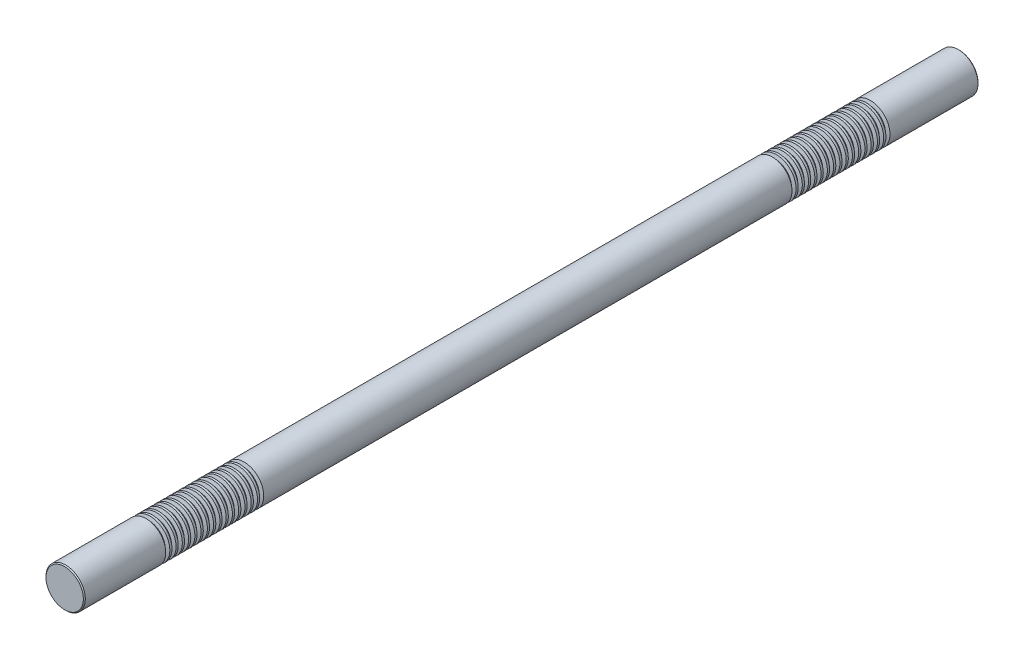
from build123d import *

# Parameters (mm, degrees)
SKETCH1_R           = 22
BOSS_EXTRUDE1_DEPTH = 500
CHAMFER1_SIZE       = 1.1
LPATTERN1_COUNT     = 16
LPATTERN1_PITCH     = 7
LPATTERN2_COUNT     = 2
LPATTERN2_PITCH     = 700


with BuildPart() as part:
    # Sketch1 → Boss-Extrude1 (new, symmetric)
    with BuildSketch(Plane.XY):
        Circle(SKETCH1_R)
    extrude(amount=BOSS_EXTRUDE1_DEPTH, both=True)

    # Chamfer1
    chamfer1_edges = [part.edges().sort_by_distance(p)[0] for p in [
        (-22, 0, -500),
        (-22, 0, 500),
    ]]
    chamfer(chamfer1_edges, length=CHAMFER1_SIZE)

    # Sketch2 → Cut-Revolve1 (revolve, cut)
    with BuildSketch(Plane(origin=(0, 0, 0), x_dir=(0, 0, -1), z_dir=(1, 0, 0)), mode=Mode.PRIVATE) as cut_revolve1_sk:
        Polygon((400.535898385, 22), (395.964101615, 22), (397.035898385, 18), (399.464101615, 18), align=None)
    cut_revolve1 = revolve(cut_revolve1_sk.sketch.rotate(Axis((0, 0, 500), (0, 0, -1)), 90), axis=Axis((0, 0, 500), (0, 0, -1)), mode=Mode.SUBTRACT)

    # LPattern1: Cut-Revolve1 ×16
    with Locations(*[(0, 0, i * LPATTERN1_PITCH) for i in range(1, LPATTERN1_COUNT)]):
        add(cut_revolve1, mode=Mode.SUBTRACT)

    # LPattern2: Cut-Revolve1 ×2
    with Locations(*[(0, 0, i * LPATTERN2_PITCH) for i in range(1, LPATTERN2_COUNT)]):
        add(cut_revolve1, mode=Mode.SUBTRACT)

    # LPattern2 copy 1 sketch → LPattern2 copy 1 (revolve, cut)
    with BuildSketch(Plane(origin=(0, 0, 707), x_dir=(0, 0, -1), z_dir=(1, 0, 0))):
        Polygon((400.535898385, 22), (395.964101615, 22), (397.035898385, 18), (399.464101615, 18), align=None)
    revolve(axis=Axis((0, 0, 1207), (0, 0, -1)), mode=Mode.SUBTRACT)

    # LPattern2 copy 2 sketch → LPattern2 copy 2 (revolve, cut)
    with BuildSketch(Plane(origin=(0, 0, 714), x_dir=(0, 0, -1), z_dir=(1, 0, 0))):
        Polygon((400.535898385, 22), (395.964101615, 22), (397.035898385, 18), (399.464101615, 18), align=None)
    revolve(axis=Axis((0, 0, 1214), (0, 0, -1)), mode=Mode.SUBTRACT)

    # LPattern2 copy 3 sketch → LPattern2 copy 3 (revolve, cut)
    with BuildSketch(Plane(origin=(0, 0, 721), x_dir=(0, 0, -1), z_dir=(1, 0, 0))):
        Polygon((400.535898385, 22), (395.964101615, 22), (397.035898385, 18), (399.464101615, 18), align=None)
    revolve(axis=Axis((0, 0, 1221), (0, 0, -1)), mode=Mode.SUBTRACT)

    # LPattern2 copy 4 sketch → LPattern2 copy 4 (revolve, cut)
    with BuildSketch(Plane(origin=(0, 0, 728), x_dir=(0, 0, -1), z_dir=(1, 0, 0))):
        Polygon((400.535898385, 22), (395.964101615, 22), (397.035898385, 18), (399.464101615, 18), align=None)
    revolve(axis=Axis((0, 0, 1228), (0, 0, -1)), mode=Mode.SUBTRACT)

    # LPattern2 copy 5 sketch → LPattern2 copy 5 (revolve, cut)
    with BuildSketch(Plane(origin=(0, 0, 735), x_dir=(0, 0, -1), z_dir=(1, 0, 0))):
        Polygon((400.535898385, 22), (395.964101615, 22), (397.035898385, 18), (399.464101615, 18), align=None)
    revolve(axis=Axis((0, 0, 1235), (0, 0, -1)), mode=Mode.SUBTRACT)

    # LPattern2 copy 6 sketch → LPattern2 copy 6 (revolve, cut)
    with BuildSketch(Plane(origin=(0, 0, 742), x_dir=(0, 0, -1), z_dir=(1, 0, 0))):
        Polygon((400.535898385, 22), (395.964101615, 22), (397.035898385, 18), (399.464101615, 18), align=None)
    revolve(axis=Axis((0, 0, 1242), (0, 0, -1)), mode=Mode.SUBTRACT)

    # LPattern2 copy 7 sketch → LPattern2 copy 7 (revolve, cut)
    with BuildSketch(Plane(origin=(0, 0, 749), x_dir=(0, 0, -1), z_dir=(1, 0, 0))):
        Polygon((400.535898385, 22), (395.964101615, 22), (397.035898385, 18), (399.464101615, 18), align=None)
    revolve(axis=Axis((0, 0, 1249), (0, 0, -1)), mode=Mode.SUBTRACT)

    # LPattern2 copy 8 sketch → LPattern2 copy 8 (revolve, cut)
    with BuildSketch(Plane(origin=(0, 0, 756), x_dir=(0, 0, -1), z_dir=(1, 0, 0))):
        Polygon((400.535898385, 22), (395.964101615, 22), (397.035898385, 18), (399.464101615, 18), align=None)
    revolve(axis=Axis((0, 0, 1256), (0, 0, -1)), mode=Mode.SUBTRACT)

    # LPattern2 copy 9 sketch → LPattern2 copy 9 (revolve, cut)
    with BuildSketch(Plane(origin=(0, 0, 763), x_dir=(0, 0, -1), z_dir=(1, 0, 0))):
        Polygon((400.535898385, 22), (395.964101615, 22), (397.035898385, 18), (399.464101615, 18), align=None)
    revolve(axis=Axis((0, 0, 1263), (0, 0, -1)), mode=Mode.SUBTRACT)

    # LPattern2 copy 10 sketch → LPattern2 copy 10 (revolve, cut)
    with BuildSketch(Plane(origin=(0, 0, 770), x_dir=(0, 0, -1), z_dir=(1, 0, 0))):
        Polygon((400.535898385, 22), (395.964101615, 22), (397.035898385, 18), (399.464101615, 18), align=None)
    revolve(axis=Axis((0, 0, 1270), (0, 0, -1)), mode=Mode.SUBTRACT)

    # LPattern2 copy 11 sketch → LPattern2 copy 11 (revolve, cut)
    with BuildSketch(Plane(origin=(0, 0, 777), x_dir=(0, 0, -1), z_dir=(1, 0, 0))):
        Polygon((400.535898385, 22), (395.964101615, 22), (397.035898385, 18), (399.464101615, 18), align=None)
    revolve(axis=Axis((0, 0, 1277), (0, 0, -1)), mode=Mode.SUBTRACT)

    # LPattern2 copy 12 sketch → LPattern2 copy 12 (revolve, cut)
    with BuildSketch(Plane(origin=(0, 0, 784), x_dir=(0, 0, -1), z_dir=(1, 0, 0))):
        Polygon((400.535898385, 22), (395.964101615, 22), (397.035898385, 18), (399.464101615, 18), align=None)
    revolve(axis=Axis((0, 0, 1284), (0, 0, -1)), mode=Mode.SUBTRACT)

    # LPattern2 copy 13 sketch → LPattern2 copy 13 (revolve, cut)
    with BuildSketch(Plane(origin=(0, 0, 791), x_dir=(0, 0, -1), z_dir=(1, 0, 0))):
        Polygon((400.535898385, 22), (395.964101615, 22), (397.035898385, 18), (399.464101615, 18), align=None)
    revolve(axis=Axis((0, 0, 1291), (0, 0, -1)), mode=Mode.SUBTRACT)

    # LPattern2 copy 14 sketch → LPattern2 copy 14 (revolve, cut)
    with BuildSketch(Plane(origin=(0, 0, 798), x_dir=(0, 0, -1), z_dir=(1, 0, 0))):
        Polygon((400.535898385, 22), (395.964101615, 22), (397.035898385, 18), (399.464101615, 18), align=None)
    revolve(axis=Axis((0, 0, 1298), (0, 0, -1)), mode=Mode.SUBTRACT)

    # LPattern2 copy 15 sketch → LPattern2 copy 15 (revolve, cut)
    with BuildSketch(Plane(origin=(0, 0, 805), x_dir=(0, 0, -1), z_dir=(1, 0, 0))):
        Polygon((400.535898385, 22), (395.964101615, 22), (397.035898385, 18), (399.464101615, 18), align=None)
    revolve(axis=Axis((0, 0, 1305), (0, 0, -1)), mode=Mode.SUBTRACT)


solid = part.part
